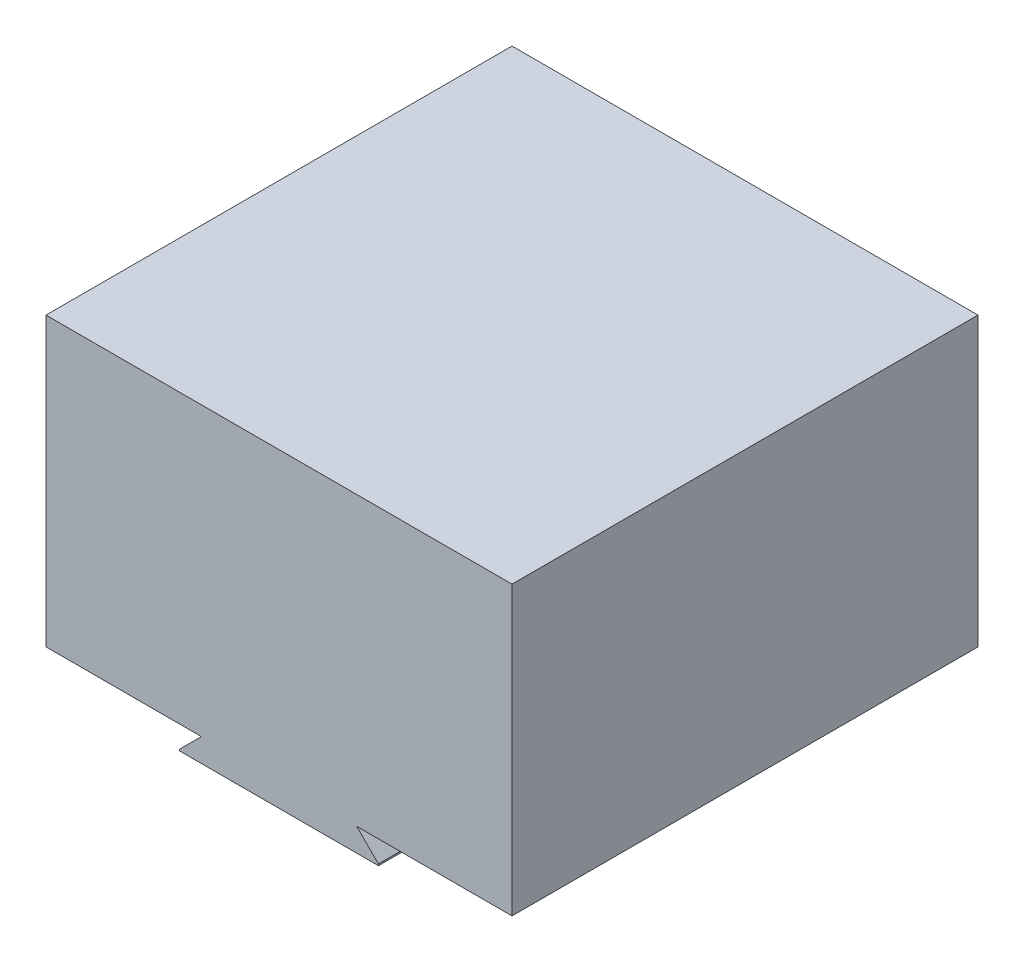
from build123d import *

# Parameters (mm, degrees)
BOSS_EXTRUDE1_DEPTH      = 38.1
BOSS_EXTRUDE1_DEPTH_BACK = 38.1
SKETCH1_W                = 76.2
SKETCH1_H                = 50.8
CUT_EXTRUDE1_DEPTH       = 89.9
CUT_EXTRUDE2_DEPTH       = 3.81


with BuildPart() as part:
    # Sketch1 → Boss-Extrude1 (new, two sides: drawn at the far end of the back side and taken through both)
    with BuildSketch(Plane.XY.offset(-BOSS_EXTRUDE1_DEPTH_BACK)):
        Rectangle(SKETCH1_W, SKETCH1_H)
    extrude(amount=BOSS_EXTRUDE1_DEPTH + BOSS_EXTRUDE1_DEPTH_BACK)

    # Sketch2 → Cut-Extrude1 (cut, through all)
    with BuildSketch(Plane.XY.offset(38.1)):
        Polygon((-16.256, -25.146), (-12.7, -21.59), (-38.1, -21.59), (-38.1, -25.4), (-16.256, -25.4), align=None)
        Polygon((16.256, -25.146), (12.7, -21.59), (38.1, -21.59), (38.1, -25.4), (16.256, -25.4), align=None)
    extrude(amount=-CUT_EXTRUDE1_DEPTH, mode=Mode.SUBTRACT)

    # Sketch3 → Cut-Extrude2 (cut)
    with BuildSketch(Plane.XZ.offset(25.4)):
        with BuildLine():
            Line((-16.51, -12.6873), (-9.906, -12.6873))
            ThreePointArc((-9.906, -12.6873), (-6.7183, -15.875), (-9.906, -19.0627))
            Line((-9.906, -19.0627), (-16.51, -19.0627))
            ThreePointArc((-16.51, -19.0627), (-19.6977, -15.875), (-16.51, -12.6873))
        make_face()
    extrude(amount=-CUT_EXTRUDE2_DEPTH, mode=Mode.SUBTRACT)


solid = part.part
